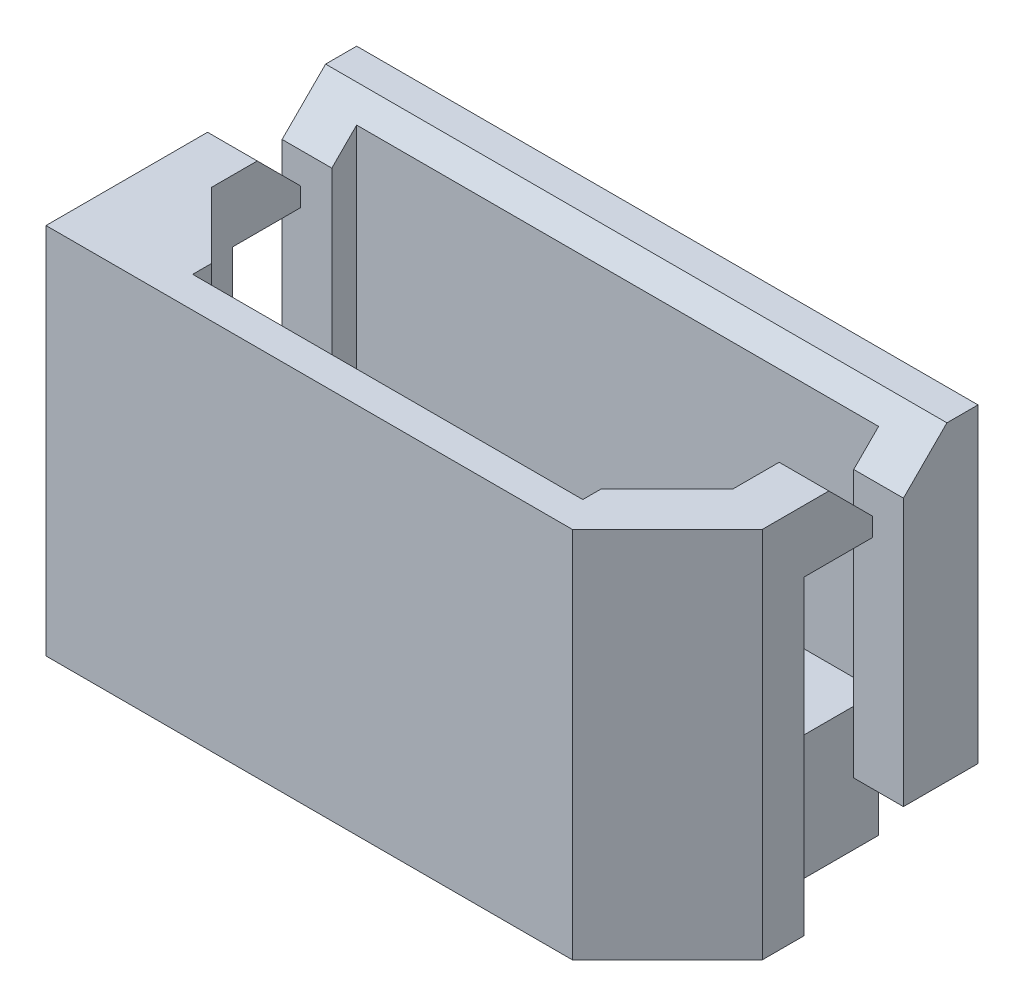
ISO-10303-21;
HEADER;
FILE_DESCRIPTION(('STEP AP214'),'2;1');
FILE_NAME('part.step','',(''),(''),'','','');
FILE_SCHEMA(('AUTOMOTIVE_DESIGN { 1 0 10303 214 1 1 1 1 }'));
ENDSEC;
DATA;
#1=APPLICATION_CONTEXT('core data for automotive mechanical design processes');
#2=APPLICATION_PROTOCOL_DEFINITION('international standard','automotive_design',2000,#1);
#3=PRODUCT_CONTEXT('',#1,'mechanical');
#4=PRODUCT('Part','Part','',(#3));
#5=PRODUCT_RELATED_PRODUCT_CATEGORY('part','',(#4));
#6=PRODUCT_DEFINITION_FORMATION('','',#4);
#7=PRODUCT_DEFINITION_CONTEXT('part definition',#1,'design');
#8=PRODUCT_DEFINITION('design','',#6,#7);
#9=PRODUCT_DEFINITION_SHAPE('','',#8);
#10=(LENGTH_UNIT() NAMED_UNIT(*) SI_UNIT(.MILLI.,.METRE.));
#11=(NAMED_UNIT(*) PLANE_ANGLE_UNIT() SI_UNIT($,.RADIAN.));
#12=(NAMED_UNIT(*) SI_UNIT($,.STERADIAN.) SOLID_ANGLE_UNIT());
#13=UNCERTAINTY_MEASURE_WITH_UNIT(LENGTH_MEASURE(1.E-05),#10,'distance_accuracy_value','');
#14=(GEOMETRIC_REPRESENTATION_CONTEXT(3) GLOBAL_UNCERTAINTY_ASSIGNED_CONTEXT((#13)) GLOBAL_UNIT_ASSIGNED_CONTEXT((#10,
#11,#12)) REPRESENTATION_CONTEXT('',''));
#15=CARTESIAN_POINT('',(0.,0.,0.));
#16=DIRECTION('',(0.,0.,1.));
#17=DIRECTION('',(1.,0.,0.));
#18=AXIS2_PLACEMENT_3D('',#15,#16,#17);
#19=CARTESIAN_POINT('',(2.75,0.,0.7));
#20=DIRECTION('',(0.,1.,0.));
#21=DIRECTION('',(0.,0.,1.));
#22=AXIS2_PLACEMENT_3D('',#19,#20,#21);
#23=CYLINDRICAL_SURFACE('',#22,0.4);
#24=CARTESIAN_POINT('',(2.75,2.,0.7));
#25=DIRECTION('',(0.,1.,0.));
#26=DIRECTION('',(0.,0.,1.));
#27=AXIS2_PLACEMENT_3D('',#24,#25,#26);
#28=CIRCLE('',#27,0.4);
#29=CARTESIAN_POINT('',(2.75,2.,1.1));
#30=VERTEX_POINT('',#29);
#31=EDGE_CURVE('E351',#30,#30,#28,.T.);
#32=ORIENTED_EDGE('',*,*,#31,.T.);
#33=EDGE_LOOP('',(#32));
#34=FACE_BOUND('',#33,.T.);
#35=CARTESIAN_POINT('',(2.75,0.,0.7));
#36=DIRECTION('',(0.,1.,0.));
#37=DIRECTION('',(0.,0.,1.));
#38=AXIS2_PLACEMENT_3D('',#35,#36,#37);
#39=CIRCLE('',#38,0.4);
#40=CARTESIAN_POINT('',(2.75,0.,1.1));
#41=VERTEX_POINT('',#40);
#42=EDGE_CURVE('E319',#41,#41,#39,.T.);
#43=ORIENTED_EDGE('',*,*,#42,.F.);
#44=EDGE_LOOP('',(#43));
#45=FACE_BOUND('',#44,.T.);
#46=ADVANCED_FACE('F17',(#34,#45),#23,.F.);
#47=CARTESIAN_POINT('',(-2.75,0.,0.7));
#48=DIRECTION('',(0.,1.,0.));
#49=DIRECTION('',(0.,0.,1.));
#50=AXIS2_PLACEMENT_3D('',#47,#48,#49);
#51=CYLINDRICAL_SURFACE('',#50,0.4);
#52=CARTESIAN_POINT('',(-2.75,2.,0.7));
#53=DIRECTION('',(0.,1.,0.));
#54=DIRECTION('',(0.,0.,1.));
#55=AXIS2_PLACEMENT_3D('',#52,#53,#54);
#56=CIRCLE('',#55,0.4);
#57=CARTESIAN_POINT('',(-2.75,2.,1.1));
#58=VERTEX_POINT('',#57);
#59=EDGE_CURVE('E348',#58,#58,#56,.T.);
#60=ORIENTED_EDGE('',*,*,#59,.T.);
#61=EDGE_LOOP('',(#60));
#62=FACE_BOUND('',#61,.T.);
#63=CARTESIAN_POINT('',(-2.75,0.,0.7));
#64=DIRECTION('',(0.,1.,0.));
#65=DIRECTION('',(0.,0.,1.));
#66=AXIS2_PLACEMENT_3D('',#63,#64,#65);
#67=CIRCLE('',#66,0.4);
#68=CARTESIAN_POINT('',(-2.75,0.,1.1));
#69=VERTEX_POINT('',#68);
#70=EDGE_CURVE('E27',#69,#69,#67,.T.);
#71=ORIENTED_EDGE('',*,*,#70,.F.);
#72=EDGE_LOOP('',(#71));
#73=FACE_BOUND('',#72,.T.);
#74=ADVANCED_FACE('F716',(#62,#73),#51,.F.);
#75=CARTESIAN_POINT('',(4.2,2.,-1.3));
#76=DIRECTION('',(1.,0.,0.));
#77=DIRECTION('',(0.,0.,-1.));
#78=AXIS2_PLACEMENT_3D('',#75,#76,#77);
#79=PLANE('',#78);
#80=DIRECTION('',(0.,-1.,0.));
#81=VECTOR('',#80,1.);
#82=CARTESIAN_POINT('',(4.2,3.8499999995,-1.7));
#83=LINE('',#82,#81);
#84=CARTESIAN_POINT('',(4.2,5.69999999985,-1.69999999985));
#85=VERTEX_POINT('',#84);
#86=CARTESIAN_POINT('',(4.2,2.,-1.7));
#87=VERTEX_POINT('',#86);
#88=EDGE_CURVE('E377',#85,#87,#83,.T.);
#89=ORIENTED_EDGE('',*,*,#88,.T.);
#90=DIRECTION('',(0.,0.,-1.));
#91=VECTOR('',#90,1.);
#92=CARTESIAN_POINT('',(4.2,2.,-1.5));
#93=LINE('',#92,#91);
#94=CARTESIAN_POINT('',(4.2,2.0000000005,-1.300000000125));
#95=VERTEX_POINT('',#94);
#96=EDGE_CURVE('E941',#95,#87,#93,.T.);
#97=ORIENTED_EDGE('',*,*,#96,.F.);
#98=DIRECTION('',(0.,1.,0.));
#99=VECTOR('',#98,1.);
#100=CARTESIAN_POINT('',(4.2,3.15,-1.3));
#101=LINE('',#100,#99);
#102=CARTESIAN_POINT('',(4.2,5.3,-1.3));
#103=VERTEX_POINT('',#102);
#104=EDGE_CURVE('E371',#95,#103,#101,.T.);
#105=ORIENTED_EDGE('',*,*,#104,.T.);
#106=DIRECTION('',(0.,0.707106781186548,-0.707106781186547));
#107=VECTOR('',#106,1.);
#108=CARTESIAN_POINT('',(4.2,5.3,-1.3));
#109=LINE('',#108,#107);
#110=EDGE_CURVE('E21',#85,#103,#109,.F.);
#111=ORIENTED_EDGE('',*,*,#110,.F.);
#112=EDGE_LOOP('',(#89,#97,#105,#111));
#113=FACE_BOUND('',#112,.T.);
#114=ADVANCED_FACE('F718',(#113),#79,.F.);
#115=CARTESIAN_POINT('',(-4.2,2.,-1.7));
#116=DIRECTION('',(-1.,0.,0.));
#117=DIRECTION('',(0.,0.,1.));
#118=AXIS2_PLACEMENT_3D('',#115,#116,#117);
#119=PLANE('',#118);
#120=DIRECTION('',(0.,-1.,0.));
#121=VECTOR('',#120,1.);
#122=CARTESIAN_POINT('',(-4.2,3.15,-1.3));
#123=LINE('',#122,#121);
#124=CARTESIAN_POINT('',(-4.2,5.29999999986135,-1.3000000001));
#125=VERTEX_POINT('',#124);
#126=CARTESIAN_POINT('',(-4.2,2.0000000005,-1.29999999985));
#127=VERTEX_POINT('',#126);
#128=EDGE_CURVE('E398',#125,#127,#123,.T.);
#129=ORIENTED_EDGE('',*,*,#128,.T.);
#130=DIRECTION('',(0.,0.,1.));
#131=VECTOR('',#130,1.);
#132=CARTESIAN_POINT('',(-4.2,2.,-1.5));
#133=LINE('',#132,#131);
#134=CARTESIAN_POINT('',(-4.2,2.,-1.7));
#135=VERTEX_POINT('',#134);
#136=EDGE_CURVE('E382',#135,#127,#133,.T.);
#137=ORIENTED_EDGE('',*,*,#136,.F.);
#138=DIRECTION('',(0.,1.,0.));
#139=VECTOR('',#138,1.);
#140=CARTESIAN_POINT('',(-4.2,3.8499999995,-1.7));
#141=LINE('',#140,#139);
#142=CARTESIAN_POINT('',(-4.2,5.69999999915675,-1.699999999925));
#143=VERTEX_POINT('',#142);
#144=EDGE_CURVE('E373',#135,#143,#141,.T.);
#145=ORIENTED_EDGE('',*,*,#144,.T.);
#146=DIRECTION('',(0.,-0.707106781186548,0.707106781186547));
#147=VECTOR('',#146,1.);
#148=CARTESIAN_POINT('',(-4.2,5.65,-1.65));
#149=LINE('',#148,#147);
#150=EDGE_CURVE('E395',#143,#125,#149,.T.);
#151=ORIENTED_EDGE('',*,*,#150,.T.);
#152=EDGE_LOOP('',(#129,#137,#145,#151));
#153=FACE_BOUND('',#152,.T.);
#154=ADVANCED_FACE('F701',(#153),#119,.F.);
#155=CARTESIAN_POINT('',(4.2,2.,-1.7));
#156=DIRECTION('',(0.,0.,-1.));
#157=DIRECTION('',(-1.,0.,0.));
#158=AXIS2_PLACEMENT_3D('',#155,#156,#157);
#159=PLANE('',#158);
#160=ORIENTED_EDGE('',*,*,#144,.F.);
#161=DIRECTION('',(1.,0.,0.));
#162=VECTOR('',#161,1.);
#163=CARTESIAN_POINT('',(0.,2.,-1.7));
#164=LINE('',#163,#162);
#165=EDGE_CURVE('E414',#135,#87,#164,.T.);
#166=ORIENTED_EDGE('',*,*,#165,.T.);
#167=ORIENTED_EDGE('',*,*,#88,.F.);
#168=DIRECTION('',(-1.,0.,0.));
#169=VECTOR('',#168,1.);
#170=CARTESIAN_POINT('',(0.,5.6999999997,-1.6999999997));
#171=LINE('',#170,#169);
#172=EDGE_CURVE('E397',#85,#143,#171,.T.);
#173=ORIENTED_EDGE('',*,*,#172,.T.);
#174=EDGE_LOOP('',(#160,#166,#167,#173));
#175=FACE_BOUND('',#174,.T.);
#176=ADVANCED_FACE('F691',(#175),#159,.F.);
#177=CARTESIAN_POINT('',(1.375,2.,1.3));
#178=DIRECTION('',(-0.707106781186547,0.,0.707106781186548));
#179=DIRECTION('',(0.707106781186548,0.,0.707106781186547));
#180=AXIS2_PLACEMENT_3D('',#177,#178,#179);
#181=PLANE('',#180);
#182=DIRECTION('',(0.,-1.,0.));
#183=VECTOR('',#182,1.);
#184=CARTESIAN_POINT('',(1.775,3.85,1.7));
#185=LINE('',#184,#183);
#186=CARTESIAN_POINT('',(1.77500000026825,5.7,1.7));
#187=VERTEX_POINT('',#186);
#188=CARTESIAN_POINT('',(1.775,2.,1.7));
#189=VERTEX_POINT('',#188);
#190=EDGE_CURVE('E401',#187,#189,#185,.T.);
#191=ORIENTED_EDGE('',*,*,#190,.T.);
#192=DIRECTION('',(0.707106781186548,0.,0.707106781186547));
#193=VECTOR('',#192,1.);
#194=CARTESIAN_POINT('',(1.375,2.,1.3));
#195=LINE('',#194,#193);
#196=CARTESIAN_POINT('',(1.375,2.,1.3));
#197=VERTEX_POINT('',#196);
#198=EDGE_CURVE('E357',#189,#197,#195,.F.);
#199=ORIENTED_EDGE('',*,*,#198,.T.);
#200=DIRECTION('',(0.,1.,0.));
#201=VECTOR('',#200,1.);
#202=CARTESIAN_POINT('',(1.375,3.8611,1.3));
#203=LINE('',#202,#201);
#204=CARTESIAN_POINT('',(1.37500000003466,5.29999999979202,1.29999999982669));
#205=VERTEX_POINT('',#204);
#206=EDGE_CURVE('E343',#197,#205,#203,.T.);
#207=ORIENTED_EDGE('',*,*,#206,.T.);
#208=DIRECTION('',(-0.577350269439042,-0.577350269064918,-0.577350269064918));
#209=VECTOR('',#208,1.);
#210=CARTESIAN_POINT('',(1.775,5.6999999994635,1.6999999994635));
#211=LINE('',#210,#209);
#212=EDGE_CURVE('E372',#187,#205,#211,.T.);
#213=ORIENTED_EDGE('',*,*,#212,.F.);
#214=EDGE_LOOP('',(#191,#199,#207,#213));
#215=FACE_BOUND('',#214,.T.);
#216=ADVANCED_FACE('F689',(#215),#181,.F.);
#217=CARTESIAN_POINT('',(-1.775,2.,1.7));
#218=DIRECTION('',(0.707106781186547,0.,0.707106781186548));
#219=DIRECTION('',(0.707106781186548,0.,-0.707106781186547));
#220=AXIS2_PLACEMENT_3D('',#217,#218,#219);
#221=PLANE('',#220);
#222=DIRECTION('',(0.,-1.,0.));
#223=VECTOR('',#222,1.);
#224=CARTESIAN_POINT('',(-1.375,3.8611,1.3));
#225=LINE('',#224,#223);
#226=CARTESIAN_POINT('',(-1.37500000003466,5.29999999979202,1.29999999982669));
#227=VERTEX_POINT('',#226);
#228=CARTESIAN_POINT('',(-1.375,2.,1.3));
#229=VERTEX_POINT('',#228);
#230=EDGE_CURVE('E369',#227,#229,#225,.T.);
#231=ORIENTED_EDGE('',*,*,#230,.T.);
#232=DIRECTION('',(0.707106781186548,0.,-0.707106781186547));
#233=VECTOR('',#232,1.);
#234=CARTESIAN_POINT('',(-1.775,2.,1.7));
#235=LINE('',#234,#233);
#236=CARTESIAN_POINT('',(-1.775,2.,1.7));
#237=VERTEX_POINT('',#236);
#238=EDGE_CURVE('E364',#229,#237,#235,.F.);
#239=ORIENTED_EDGE('',*,*,#238,.T.);
#240=DIRECTION('',(0.,1.,0.));
#241=VECTOR('',#240,1.);
#242=CARTESIAN_POINT('',(-1.775,3.85,1.7));
#243=LINE('',#242,#241);
#244=CARTESIAN_POINT('',(-1.77500000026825,5.7,1.7));
#245=VERTEX_POINT('',#244);
#246=EDGE_CURVE('E562',#237,#245,#243,.T.);
#247=ORIENTED_EDGE('',*,*,#246,.T.);
#248=DIRECTION('',(-0.577350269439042,0.577350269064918,0.577350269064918));
#249=VECTOR('',#248,1.);
#250=CARTESIAN_POINT('',(-1.375,5.2999999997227,1.2999999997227));
#251=LINE('',#250,#249);
#252=EDGE_CURVE('E370',#227,#245,#251,.T.);
#253=ORIENTED_EDGE('',*,*,#252,.F.);
#254=EDGE_LOOP('',(#231,#239,#247,#253));
#255=FACE_BOUND('',#254,.T.);
#256=ADVANCED_FACE('F674',(#255),#221,.F.);
#257=CARTESIAN_POINT('',(4.2,1.,-1.3));
#258=DIRECTION('',(0.,0.,-1.));
#259=DIRECTION('',(0.,1.,0.));
#260=AXIS2_PLACEMENT_3D('',#257,#258,#259);
#261=PLANE('',#260);
#262=DIRECTION('',(-1.,0.,0.));
#263=VECTOR('',#262,1.);
#264=CARTESIAN_POINT('',(4.6,1.,-1.3));
#265=LINE('',#264,#263);
#266=CARTESIAN_POINT('',(5.,1.,-1.3));
#267=VERTEX_POINT('',#266);
#268=CARTESIAN_POINT('',(4.2,1.,-1.3));
#269=VERTEX_POINT('',#268);
#270=EDGE_CURVE('E389',#267,#269,#265,.T.);
#271=ORIENTED_EDGE('',*,*,#270,.F.);
#272=DIRECTION('',(0.,1.,0.));
#273=VECTOR('',#272,1.);
#274=CARTESIAN_POINT('',(5.,3.5,-1.3));
#275=LINE('',#274,#273);
#276=CARTESIAN_POINT('',(5.,5.3,-1.3));
#277=VERTEX_POINT('',#276);
#278=EDGE_CURVE('E339',#267,#277,#275,.T.);
#279=ORIENTED_EDGE('',*,*,#278,.T.);
#280=DIRECTION('',(-1.,0.,0.));
#281=VECTOR('',#280,1.);
#282=CARTESIAN_POINT('',(0.,5.3,-1.3));
#283=LINE('',#282,#281);
#284=EDGE_CURVE('E388',#277,#103,#283,.T.);
#285=ORIENTED_EDGE('',*,*,#284,.T.);
#286=ORIENTED_EDGE('',*,*,#104,.F.);
#287=DIRECTION('',(0.,1.,0.));
#288=VECTOR('',#287,1.);
#289=CARTESIAN_POINT('',(4.2,3.15,-1.3));
#290=LINE('',#289,#288);
#291=EDGE_CURVE('E163',#269,#95,#290,.T.);
#292=ORIENTED_EDGE('',*,*,#291,.F.);
#293=EDGE_LOOP('',(#271,#279,#285,#286,#292));
#294=FACE_BOUND('',#293,.T.);
#295=ADVANCED_FACE('F698',(#294),#261,.F.);
#296=CARTESIAN_POINT('',(-5.,5.3,-1.3));
#297=DIRECTION('',(0.,-0.707106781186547,-0.707106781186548));
#298=DIRECTION('',(0.,0.707106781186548,-0.707106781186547));
#299=AXIS2_PLACEMENT_3D('',#296,#297,#298);
#300=PLANE('',#299);
#301=DIRECTION('',(-1.,0.,0.));
#302=VECTOR('',#301,1.);
#303=CARTESIAN_POINT('',(0.,6.,-2.));
#304=LINE('',#303,#302);
#305=CARTESIAN_POINT('',(5.,6.,-2.));
#306=VERTEX_POINT('',#305);
#307=CARTESIAN_POINT('',(-5.,6.,-1.9999999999));
#308=VERTEX_POINT('',#307);
#309=EDGE_CURVE('E433',#306,#308,#304,.T.);
#310=ORIENTED_EDGE('',*,*,#309,.T.);
#311=DIRECTION('',(0.,0.707106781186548,-0.707106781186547));
#312=VECTOR('',#311,1.);
#313=CARTESIAN_POINT('',(-5.,5.65,-1.65));
#314=LINE('',#313,#312);
#315=CARTESIAN_POINT('',(-5.,5.3,-1.3));
#316=VERTEX_POINT('',#315);
#317=EDGE_CURVE('E392',#316,#308,#314,.T.);
#318=ORIENTED_EDGE('',*,*,#317,.F.);
#319=DIRECTION('',(1.,0.,0.));
#320=VECTOR('',#319,1.);
#321=CARTESIAN_POINT('',(-4.6,5.3,-1.3));
#322=LINE('',#321,#320);
#323=EDGE_CURVE('E402',#316,#125,#322,.T.);
#324=ORIENTED_EDGE('',*,*,#323,.T.);
#325=ORIENTED_EDGE('',*,*,#150,.F.);
#326=ORIENTED_EDGE('',*,*,#172,.F.);
#327=ORIENTED_EDGE('',*,*,#110,.T.);
#328=ORIENTED_EDGE('',*,*,#284,.F.);
#329=DIRECTION('',(0.,0.707106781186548,-0.707106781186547));
#330=VECTOR('',#329,1.);
#331=CARTESIAN_POINT('',(5.,5.3,-1.3));
#332=LINE('',#331,#330);
#333=EDGE_CURVE('E336',#277,#306,#332,.T.);
#334=ORIENTED_EDGE('',*,*,#333,.T.);
#335=EDGE_LOOP('',(#310,#318,#324,#325,#326,#327,#328,#334));
#336=FACE_BOUND('',#335,.T.);
#337=ADVANCED_FACE('F731',(#336),#300,.F.);
#338=CARTESIAN_POINT('',(-5.,1.,-1.3));
#339=DIRECTION('',(0.,0.,-1.));
#340=DIRECTION('',(0.,1.,0.));
#341=AXIS2_PLACEMENT_3D('',#338,#339,#340);
#342=PLANE('',#341);
#343=ORIENTED_EDGE('',*,*,#323,.F.);
#344=DIRECTION('',(0.,-1.,0.));
#345=VECTOR('',#344,1.);
#346=CARTESIAN_POINT('',(-5.,3.5,-1.3));
#347=LINE('',#346,#345);
#348=CARTESIAN_POINT('',(-5.,1.,-1.3));
#349=VERTEX_POINT('',#348);
#350=EDGE_CURVE('E430',#316,#349,#347,.T.);
#351=ORIENTED_EDGE('',*,*,#350,.T.);
#352=DIRECTION('',(-1.,0.,0.));
#353=VECTOR('',#352,1.);
#354=CARTESIAN_POINT('',(-4.6,1.,-1.3));
#355=LINE('',#354,#353);
#356=CARTESIAN_POINT('',(-4.2,1.,-1.3));
#357=VERTEX_POINT('',#356);
#358=EDGE_CURVE('E405',#357,#349,#355,.T.);
#359=ORIENTED_EDGE('',*,*,#358,.F.);
#360=DIRECTION('',(0.,-1.,0.));
#361=VECTOR('',#360,1.);
#362=CARTESIAN_POINT('',(-4.2,3.15,-1.3));
#363=LINE('',#362,#361);
#364=EDGE_CURVE('E394',#127,#357,#363,.T.);
#365=ORIENTED_EDGE('',*,*,#364,.F.);
#366=ORIENTED_EDGE('',*,*,#128,.F.);
#367=EDGE_LOOP('',(#343,#351,#359,#365,#366));
#368=FACE_BOUND('',#367,.T.);
#369=ADVANCED_FACE('F729',(#368),#342,.F.);
#370=CARTESIAN_POINT('',(1.775,2.,1.7));
#371=DIRECTION('',(0.,0.,1.));
#372=DIRECTION('',(1.,0.,0.));
#373=AXIS2_PLACEMENT_3D('',#370,#371,#372);
#374=PLANE('',#373);
#375=DIRECTION('',(0.,-1.,0.));
#376=VECTOR('',#375,1.);
#377=CARTESIAN_POINT('',(3.139339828,4.,1.7));
#378=LINE('',#377,#376);
#379=CARTESIAN_POINT('',(3.13933982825,5.69999999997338,1.7));
#380=VERTEX_POINT('',#379);
#381=CARTESIAN_POINT('',(3.1393398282,2.,1.7));
#382=VERTEX_POINT('',#381);
#383=EDGE_CURVE('E438',#380,#382,#378,.T.);
#384=ORIENTED_EDGE('',*,*,#383,.T.);
#385=DIRECTION('',(-1.,0.,0.));
#386=VECTOR('',#385,1.);
#387=CARTESIAN_POINT('',(0.,2.,1.7));
#388=LINE('',#387,#386);
#389=EDGE_CURVE('E359',#382,#189,#388,.T.);
#390=ORIENTED_EDGE('',*,*,#389,.T.);
#391=ORIENTED_EDGE('',*,*,#190,.F.);
#392=DIRECTION('',(-1.,0.,0.));
#393=VECTOR('',#392,1.);
#394=CARTESIAN_POINT('',(2.457169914,5.7,1.7));
#395=LINE('',#394,#393);
#396=EDGE_CURVE('E555',#380,#187,#395,.T.);
#397=ORIENTED_EDGE('',*,*,#396,.F.);
#398=EDGE_LOOP('',(#384,#390,#391,#397));
#399=FACE_BOUND('',#398,.T.);
#400=ADVANCED_FACE('F688',(#399),#374,.F.);
#401=CARTESIAN_POINT('',(-1.375,2.,1.3));
#402=DIRECTION('',(-0.707106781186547,0.,0.707106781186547));
#403=DIRECTION('',(0.707106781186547,0.,0.707106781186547));
#404=AXIS2_PLACEMENT_3D('',#401,#402,#403);
#405=PLANE('',#404);
#406=DIRECTION('',(0.,-1.,0.));
#407=VECTOR('',#406,1.);
#408=CARTESIAN_POINT('',(-0.975,3.85,1.7));
#409=LINE('',#408,#407);
#410=CARTESIAN_POINT('',(-0.974999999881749,5.6999999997,1.699999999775));
#411=VERTEX_POINT('',#410);
#412=CARTESIAN_POINT('',(-0.975,2.,1.7));
#413=VERTEX_POINT('',#412);
#414=EDGE_CURVE('E437',#411,#413,#409,.T.);
#415=ORIENTED_EDGE('',*,*,#414,.T.);
#416=DIRECTION('',(0.707106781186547,0.,0.707106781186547));
#417=VECTOR('',#416,1.);
#418=CARTESIAN_POINT('',(-1.375,2.,1.3));
#419=LINE('',#418,#417);
#420=EDGE_CURVE('E354',#413,#229,#419,.F.);
#421=ORIENTED_EDGE('',*,*,#420,.T.);
#422=ORIENTED_EDGE('',*,*,#230,.F.);
#423=DIRECTION('',(-0.577350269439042,-0.577350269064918,-0.577350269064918));
#424=VECTOR('',#423,1.);
#425=CARTESIAN_POINT('',(-0.975,5.6999999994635,1.6999999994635));
#426=LINE('',#425,#424);
#427=EDGE_CURVE('E366',#411,#227,#426,.T.);
#428=ORIENTED_EDGE('',*,*,#427,.F.);
#429=EDGE_LOOP('',(#415,#421,#422,#428));
#430=FACE_BOUND('',#429,.T.);
#431=ADVANCED_FACE('F676',(#430),#405,.F.);
#432=CARTESIAN_POINT('',(-4.2,2.,1.7));
#433=DIRECTION('',(0.,-1.,0.));
#434=DIRECTION('',(0.,0.,-1.));
#435=AXIS2_PLACEMENT_3D('',#432,#433,#434);
#436=PLANE('',#435);
#437=CARTESIAN_POINT('',(0.,2.,0.7));
#438=DIRECTION('',(0.,1.,0.));
#439=DIRECTION('',(0.,0.,1.));
#440=AXIS2_PLACEMENT_3D('',#437,#438,#439);
#441=CIRCLE('',#440,0.4);
#442=CARTESIAN_POINT('',(0.,2.,1.1));
#443=VERTEX_POINT('',#442);
#444=EDGE_CURVE('E344',#443,#443,#441,.T.);
#445=ORIENTED_EDGE('',*,*,#444,.F.);
#446=EDGE_LOOP('',(#445));
#447=FACE_BOUND('',#446,.T.);
#448=ORIENTED_EDGE('',*,*,#59,.F.);
#449=EDGE_LOOP('',(#448));
#450=FACE_BOUND('',#449,.T.);
#451=ORIENTED_EDGE('',*,*,#31,.F.);
#452=EDGE_LOOP('',(#451));
#453=FACE_BOUND('',#452,.T.);
#454=DIRECTION('',(1.,0.,0.));
#455=VECTOR('',#454,1.);
#456=CARTESIAN_POINT('',(1.00000005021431E-09,2.,1.7));
#457=LINE('',#456,#455);
#458=CARTESIAN_POINT('',(0.9750000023,2.,1.7));
#459=VERTEX_POINT('',#458);
#460=EDGE_CURVE('E567',#413,#459,#457,.T.);
#461=ORIENTED_EDGE('',*,*,#460,.T.);
#462=DIRECTION('',(0.707106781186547,0.,-0.707106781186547));
#463=VECTOR('',#462,1.);
#464=CARTESIAN_POINT('',(1.175,2.,1.5));
#465=LINE('',#464,#463);
#466=EDGE_CURVE('E347',#459,#197,#465,.T.);
#467=ORIENTED_EDGE('',*,*,#466,.T.);
#468=ORIENTED_EDGE('',*,*,#198,.F.);
#469=ORIENTED_EDGE('',*,*,#389,.F.);
#470=DIRECTION('',(0.707106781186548,0.,-0.707106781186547));
#471=VECTOR('',#470,1.);
#472=CARTESIAN_POINT('',(3.669669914,2.,1.169669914));
#473=LINE('',#472,#471);
#474=CARTESIAN_POINT('',(4.2,2.,0.6393398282));
#475=VERTEX_POINT('',#474);
#476=EDGE_CURVE('E434',#382,#475,#473,.T.);
#477=ORIENTED_EDGE('',*,*,#476,.T.);
#478=DIRECTION('',(0.,0.,1.));
#479=VECTOR('',#478,1.);
#480=CARTESIAN_POINT('',(4.2,2.,0.));
#481=LINE('',#480,#479);
#482=CARTESIAN_POINT('',(4.2,1.99999999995,0.299999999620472));
#483=VERTEX_POINT('',#482);
#484=EDGE_CURVE('E409',#483,#475,#481,.T.);
#485=ORIENTED_EDGE('',*,*,#484,.F.);
#486=DIRECTION('',(0.,0.,1.));
#487=VECTOR('',#486,1.);
#488=CARTESIAN_POINT('',(4.2,2.,0.));
#489=LINE('',#488,#487);
#490=EDGE_CURVE('E411',#95,#483,#489,.T.);
#491=ORIENTED_EDGE('',*,*,#490,.F.);
#492=ORIENTED_EDGE('',*,*,#96,.T.);
#493=ORIENTED_EDGE('',*,*,#165,.F.);
#494=ORIENTED_EDGE('',*,*,#136,.T.);
#495=DIRECTION('',(0.,0.,-1.));
#496=VECTOR('',#495,1.);
#497=CARTESIAN_POINT('',(-4.2,2.,0.));
#498=LINE('',#497,#496);
#499=CARTESIAN_POINT('',(-4.2,2.,0.299999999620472));
#500=VERTEX_POINT('',#499);
#501=EDGE_CURVE('E417',#500,#127,#498,.T.);
#502=ORIENTED_EDGE('',*,*,#501,.F.);
#503=DIRECTION('',(0.,0.,-1.));
#504=VECTOR('',#503,1.);
#505=CARTESIAN_POINT('',(-4.2,2.,0.));
#506=LINE('',#505,#504);
#507=CARTESIAN_POINT('',(-4.2,2.,0.639339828));
#508=VERTEX_POINT('',#507);
#509=EDGE_CURVE('E363',#508,#500,#506,.T.);
#510=ORIENTED_EDGE('',*,*,#509,.F.);
#511=DIRECTION('',(0.707106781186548,0.,0.707106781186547));
#512=VECTOR('',#511,1.);
#513=CARTESIAN_POINT('',(-4.2,2.,0.639339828));
#514=LINE('',#513,#512);
#515=CARTESIAN_POINT('',(-3.139339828,2.,1.7));
#516=VERTEX_POINT('',#515);
#517=EDGE_CURVE('E360',#516,#508,#514,.F.);
#518=ORIENTED_EDGE('',*,*,#517,.F.);
#519=DIRECTION('',(1.,0.,0.));
#520=VECTOR('',#519,1.);
#521=CARTESIAN_POINT('',(-2.457169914,2.,1.7));
#522=LINE('',#521,#520);
#523=EDGE_CURVE('E342',#516,#237,#522,.T.);
#524=ORIENTED_EDGE('',*,*,#523,.T.);
#525=ORIENTED_EDGE('',*,*,#238,.F.);
#526=ORIENTED_EDGE('',*,*,#420,.F.);
#527=EDGE_LOOP('',(#461,#467,#468,#469,#477,#485,#491,#492,#493,#494,#502,#510,#518,#524,#525,#526));
#528=FACE_BOUND('',#527,.T.);
#529=ADVANCED_FACE('F627',(#447,#450,#453,#528),#436,.F.);
#530=CARTESIAN_POINT('',(0.975,2.,1.7));
#531=DIRECTION('',(0.707106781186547,0.,0.707106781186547));
#532=DIRECTION('',(0.707106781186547,0.,-0.707106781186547));
#533=AXIS2_PLACEMENT_3D('',#530,#531,#532);
#534=PLANE('',#533);
#535=ORIENTED_EDGE('',*,*,#206,.F.);
#536=ORIENTED_EDGE('',*,*,#466,.F.);
#537=DIRECTION('',(0.,1.,0.));
#538=VECTOR('',#537,1.);
#539=CARTESIAN_POINT('',(0.975000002,3.85,1.7));
#540=LINE('',#539,#538);
#541=CARTESIAN_POINT('',(0.975000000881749,5.6999999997,1.699999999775));
#542=VERTEX_POINT('',#541);
#543=EDGE_CURVE('E445',#459,#542,#540,.T.);
#544=ORIENTED_EDGE('',*,*,#543,.T.);
#545=DIRECTION('',(-0.577350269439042,0.577350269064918,0.577350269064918));
#546=VECTOR('',#545,1.);
#547=CARTESIAN_POINT('',(1.375,5.2999999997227,1.2999999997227));
#548=LINE('',#547,#546);
#549=EDGE_CURVE('E340',#205,#542,#548,.T.);
#550=ORIENTED_EDGE('',*,*,#549,.F.);
#551=EDGE_LOOP('',(#535,#536,#544,#550));
#552=FACE_BOUND('',#551,.T.);
#553=ADVANCED_FACE('F683',(#552),#534,.F.);
#554=CARTESIAN_POINT('',(-3.139339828,2.,1.7));
#555=DIRECTION('',(0.,0.,1.));
#556=DIRECTION('',(1.,0.,0.));
#557=AXIS2_PLACEMENT_3D('',#554,#555,#556);
#558=PLANE('',#557);
#559=ORIENTED_EDGE('',*,*,#246,.F.);
#560=ORIENTED_EDGE('',*,*,#523,.F.);
#561=DIRECTION('',(0.,1.,0.));
#562=VECTOR('',#561,1.);
#563=CARTESIAN_POINT('',(-3.139339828,4.,1.7));
#564=LINE('',#563,#562);
#565=CARTESIAN_POINT('',(-3.139339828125,5.69999999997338,1.70000000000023));
#566=VERTEX_POINT('',#565);
#567=EDGE_CURVE('E444',#516,#566,#564,.T.);
#568=ORIENTED_EDGE('',*,*,#567,.T.);
#569=DIRECTION('',(-1.,0.,0.));
#570=VECTOR('',#569,1.);
#571=CARTESIAN_POINT('',(-2.457169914,5.7,1.7));
#572=LINE('',#571,#570);
#573=EDGE_CURVE('E423',#245,#566,#572,.T.);
#574=ORIENTED_EDGE('',*,*,#573,.F.);
#575=EDGE_LOOP('',(#559,#560,#568,#574));
#576=FACE_BOUND('',#575,.T.);
#577=ADVANCED_FACE('F670',(#576),#558,.F.);
#578=CARTESIAN_POINT('',(5.,1.,-2.5));
#579=DIRECTION('',(-1.,0.,0.));
#580=DIRECTION('',(0.,0.,1.));
#581=AXIS2_PLACEMENT_3D('',#578,#579,#580);
#582=PLANE('',#581);
#583=ORIENTED_EDGE('',*,*,#278,.F.);
#584=DIRECTION('',(0.,0.,1.));
#585=VECTOR('',#584,1.);
#586=CARTESIAN_POINT('',(5.,1.,-1.9));
#587=LINE('',#586,#585);
#588=CARTESIAN_POINT('',(5.,1.,-2.5));
#589=VERTEX_POINT('',#588);
#590=EDGE_CURVE('E420',#589,#267,#587,.T.);
#591=ORIENTED_EDGE('',*,*,#590,.F.);
#592=DIRECTION('',(0.,1.,0.));
#593=VECTOR('',#592,1.);
#594=CARTESIAN_POINT('',(5.,3.5,-2.5));
#595=LINE('',#594,#593);
#596=CARTESIAN_POINT('',(5.,6.,-2.5));
#597=VERTEX_POINT('',#596);
#598=EDGE_CURVE('E453',#589,#597,#595,.T.);
#599=ORIENTED_EDGE('',*,*,#598,.T.);
#600=DIRECTION('',(0.,0.,1.));
#601=VECTOR('',#600,1.);
#602=CARTESIAN_POINT('',(5.,6.,-2.25));
#603=LINE('',#602,#601);
#604=EDGE_CURVE('E338',#597,#306,#603,.T.);
#605=ORIENTED_EDGE('',*,*,#604,.T.);
#606=ORIENTED_EDGE('',*,*,#333,.F.);
#607=EDGE_LOOP('',(#583,#591,#599,#605,#606));
#608=FACE_BOUND('',#607,.T.);
#609=ADVANCED_FACE('F852',(#608),#582,.F.);
#610=CARTESIAN_POINT('',(-5.,6.,-2.));
#611=DIRECTION('',(0.,-1.,0.));
#612=DIRECTION('',(0.,0.,-1.));
#613=AXIS2_PLACEMENT_3D('',#610,#611,#612);
#614=PLANE('',#613);
#615=ORIENTED_EDGE('',*,*,#604,.F.);
#616=DIRECTION('',(-1.,0.,0.));
#617=VECTOR('',#616,1.);
#618=CARTESIAN_POINT('',(0.,6.,-2.5));
#619=LINE('',#618,#617);
#620=CARTESIAN_POINT('',(-5.,6.,-2.5));
#621=VERTEX_POINT('',#620);
#622=EDGE_CURVE('E450',#597,#621,#619,.T.);
#623=ORIENTED_EDGE('',*,*,#622,.T.);
#624=DIRECTION('',(0.,0.,1.));
#625=VECTOR('',#624,1.);
#626=CARTESIAN_POINT('',(-5.,6.,-1.9));
#627=LINE('',#626,#625);
#628=EDGE_CURVE('E424',#621,#308,#627,.T.);
#629=ORIENTED_EDGE('',*,*,#628,.T.);
#630=ORIENTED_EDGE('',*,*,#309,.F.);
#631=EDGE_LOOP('',(#615,#623,#629,#630));
#632=FACE_BOUND('',#631,.T.);
#633=ADVANCED_FACE('F845',(#632),#614,.F.);
#634=CARTESIAN_POINT('',(-5.,1.,-1.3));
#635=DIRECTION('',(1.,0.,0.));
#636=DIRECTION('',(0.,0.,-1.));
#637=AXIS2_PLACEMENT_3D('',#634,#635,#636);
#638=PLANE('',#637);
#639=ORIENTED_EDGE('',*,*,#628,.F.);
#640=DIRECTION('',(0.,-1.,0.));
#641=VECTOR('',#640,1.);
#642=CARTESIAN_POINT('',(-5.,3.5,-2.5));
#643=LINE('',#642,#641);
#644=CARTESIAN_POINT('',(-5.,1.,-2.5));
#645=VERTEX_POINT('',#644);
#646=EDGE_CURVE('E446',#621,#645,#643,.T.);
#647=ORIENTED_EDGE('',*,*,#646,.T.);
#648=DIRECTION('',(0.,0.,-1.));
#649=VECTOR('',#648,1.);
#650=CARTESIAN_POINT('',(-5.,1.,-1.9));
#651=LINE('',#650,#649);
#652=EDGE_CURVE('E428',#349,#645,#651,.T.);
#653=ORIENTED_EDGE('',*,*,#652,.F.);
#654=ORIENTED_EDGE('',*,*,#350,.F.);
#655=ORIENTED_EDGE('',*,*,#317,.T.);
#656=EDGE_LOOP('',(#639,#647,#653,#654,#655));
#657=FACE_BOUND('',#656,.T.);
#658=ADVANCED_FACE('F734',(#657),#638,.F.);
#659=CARTESIAN_POINT('',(3.139339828,2.,1.7));
#660=DIRECTION('',(0.707106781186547,0.,0.707106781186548));
#661=DIRECTION('',(0.707106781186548,0.,-0.707106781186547));
#662=AXIS2_PLACEMENT_3D('',#659,#660,#661);
#663=PLANE('',#662);
#664=ORIENTED_EDGE('',*,*,#476,.F.);
#665=ORIENTED_EDGE('',*,*,#383,.F.);
#666=DIRECTION('',(0.,-1.,0.));
#667=VECTOR('',#666,1.);
#668=CARTESIAN_POINT('',(3.139339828,4.,1.7));
#669=LINE('',#668,#667);
#670=CARTESIAN_POINT('',(3.1393398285,6.,1.69999999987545));
#671=VERTEX_POINT('',#670);
#672=EDGE_CURVE('E441',#671,#380,#669,.T.);
#673=ORIENTED_EDGE('',*,*,#672,.F.);
#674=DIRECTION('',(-0.707106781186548,0.,0.707106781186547));
#675=VECTOR('',#674,1.);
#676=CARTESIAN_POINT('',(3.669669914,6.,1.169669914));
#677=LINE('',#676,#675);
#678=CARTESIAN_POINT('',(4.2,6.,0.6393398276));
#679=VERTEX_POINT('',#678);
#680=EDGE_CURVE('E427',#679,#671,#677,.T.);
#681=ORIENTED_EDGE('',*,*,#680,.F.);
#682=DIRECTION('',(0.,-1.,0.));
#683=VECTOR('',#682,1.);
#684=CARTESIAN_POINT('',(4.2,4.,0.639339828));
#685=LINE('',#684,#683);
#686=EDGE_CURVE('E456',#679,#475,#685,.T.);
#687=ORIENTED_EDGE('',*,*,#686,.T.);
#688=EDGE_LOOP('',(#664,#665,#673,#681,#687));
#689=FACE_BOUND('',#688,.T.);
#690=ADVANCED_FACE('F654',(#689),#663,.F.);
#691=CARTESIAN_POINT('',(-0.975,2.,1.7));
#692=DIRECTION('',(0.,0.,1.));
#693=DIRECTION('',(1.,0.,0.));
#694=AXIS2_PLACEMENT_3D('',#691,#692,#693);
#695=PLANE('',#694);
#696=ORIENTED_EDGE('',*,*,#543,.F.);
#697=ORIENTED_EDGE('',*,*,#460,.F.);
#698=ORIENTED_EDGE('',*,*,#414,.F.);
#699=DIRECTION('',(1.,0.,0.));
#700=VECTOR('',#699,1.);
#701=CARTESIAN_POINT('',(0.,5.6999999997,1.6999999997));
#702=LINE('',#701,#700);
#703=EDGE_CURVE('E335',#411,#542,#702,.T.);
#704=ORIENTED_EDGE('',*,*,#703,.T.);
#705=EDGE_LOOP('',(#696,#697,#698,#704));
#706=FACE_BOUND('',#705,.T.);
#707=ADVANCED_FACE('F680',(#706),#695,.F.);
#708=CARTESIAN_POINT('',(-4.2,2.,0.639339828));
#709=DIRECTION('',(-0.707106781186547,0.,0.707106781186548));
#710=DIRECTION('',(0.707106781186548,0.,0.707106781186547));
#711=AXIS2_PLACEMENT_3D('',#708,#709,#710);
#712=PLANE('',#711);
#713=ORIENTED_EDGE('',*,*,#567,.F.);
#714=ORIENTED_EDGE('',*,*,#517,.T.);
#715=DIRECTION('',(0.,1.,0.));
#716=VECTOR('',#715,1.);
#717=CARTESIAN_POINT('',(-4.2,4.,0.639339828));
#718=LINE('',#717,#716);
#719=CARTESIAN_POINT('',(-4.2,6.,0.6393398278));
#720=VERTEX_POINT('',#719);
#721=EDGE_CURVE('E487',#508,#720,#718,.T.);
#722=ORIENTED_EDGE('',*,*,#721,.T.);
#723=DIRECTION('',(-0.707106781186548,0.,-0.707106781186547));
#724=VECTOR('',#723,1.);
#725=CARTESIAN_POINT('',(-3.669669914,6.,1.169669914));
#726=LINE('',#725,#724);
#727=CARTESIAN_POINT('',(-3.1393398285,6.,1.69999999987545));
#728=VERTEX_POINT('',#727);
#729=EDGE_CURVE('E442',#728,#720,#726,.T.);
#730=ORIENTED_EDGE('',*,*,#729,.F.);
#731=DIRECTION('',(0.,1.,0.));
#732=VECTOR('',#731,1.);
#733=CARTESIAN_POINT('',(-3.139339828,5.8491,1.7000000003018));
#734=LINE('',#733,#732);
#735=EDGE_CURVE('E468',#566,#728,#734,.T.);
#736=ORIENTED_EDGE('',*,*,#735,.F.);
#737=EDGE_LOOP('',(#713,#714,#722,#730,#736));
#738=FACE_BOUND('',#737,.T.);
#739=ADVANCED_FACE('F666',(#738),#712,.F.);
#740=CARTESIAN_POINT('',(-5.,1.,-2.5));
#741=DIRECTION('',(0.,0.,1.));
#742=DIRECTION('',(1.,0.,0.));
#743=AXIS2_PLACEMENT_3D('',#740,#741,#742);
#744=PLANE('',#743);
#745=ORIENTED_EDGE('',*,*,#646,.F.);
#746=ORIENTED_EDGE('',*,*,#622,.F.);
#747=ORIENTED_EDGE('',*,*,#598,.F.);
#748=DIRECTION('',(-1.,0.,0.));
#749=VECTOR('',#748,1.);
#750=CARTESIAN_POINT('',(0.,1.,-2.5));
#751=LINE('',#750,#749);
#752=EDGE_CURVE('E478',#589,#645,#751,.T.);
#753=ORIENTED_EDGE('',*,*,#752,.T.);
#754=EDGE_LOOP('',(#745,#746,#747,#753));
#755=FACE_BOUND('',#754,.T.);
#756=ADVANCED_FACE('F766',(#755),#744,.F.);
#757=CARTESIAN_POINT('',(4.2,2.,0.639339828));
#758=DIRECTION('',(1.,0.,0.));
#759=DIRECTION('',(0.,0.,-1.));
#760=AXIS2_PLACEMENT_3D('',#757,#758,#759);
#761=PLANE('',#760);
#762=DIRECTION('',(0.,-1.,0.));
#763=VECTOR('',#762,1.);
#764=CARTESIAN_POINT('',(4.2,5.15,-0.8));
#765=LINE('',#764,#763);
#766=CARTESIAN_POINT('',(4.2,5.3,-0.8));
#767=VERTEX_POINT('',#766);
#768=CARTESIAN_POINT('',(4.2,5.,-0.8));
#769=VERTEX_POINT('',#768);
#770=EDGE_CURVE('E459',#767,#769,#765,.T.);
#771=ORIENTED_EDGE('',*,*,#770,.T.);
#772=DIRECTION('',(0.,0.,1.));
#773=VECTOR('',#772,1.);
#774=CARTESIAN_POINT('',(4.2,5.,-0.25));
#775=LINE('',#774,#773);
#776=CARTESIAN_POINT('',(4.2,4.99999999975,0.299999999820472));
#777=VERTEX_POINT('',#776);
#778=EDGE_CURVE('E464',#769,#777,#775,.T.);
#779=ORIENTED_EDGE('',*,*,#778,.T.);
#780=DIRECTION('',(0.,-1.,0.));
#781=VECTOR('',#780,1.);
#782=CARTESIAN_POINT('',(4.2,2.4999999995,0.3));
#783=LINE('',#782,#781);
#784=EDGE_CURVE('E488',#777,#483,#783,.T.);
#785=ORIENTED_EDGE('',*,*,#784,.T.);
#786=ORIENTED_EDGE('',*,*,#484,.T.);
#787=ORIENTED_EDGE('',*,*,#686,.F.);
#788=DIRECTION('',(0.,0.,1.));
#789=VECTOR('',#788,1.);
#790=CARTESIAN_POINT('',(4.2,6.,-0.080330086));
#791=LINE('',#790,#789);
#792=CARTESIAN_POINT('',(4.2,6.,-0.10000000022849));
#793=VERTEX_POINT('',#792);
#794=EDGE_CURVE('E449',#793,#679,#791,.T.);
#795=ORIENTED_EDGE('',*,*,#794,.F.);
#796=DIRECTION('',(0.,-0.707106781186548,-0.707106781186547));
#797=VECTOR('',#796,1.);
#798=CARTESIAN_POINT('',(4.2,5.65,-0.45));
#799=LINE('',#798,#797);
#800=EDGE_CURVE('E334',#793,#767,#799,.T.);
#801=ORIENTED_EDGE('',*,*,#800,.T.);
#802=EDGE_LOOP('',(#771,#779,#785,#786,#787,#795,#801));
#803=FACE_BOUND('',#802,.T.);
#804=ADVANCED_FACE('F648',(#803),#761,.F.);
#805=CARTESIAN_POINT('',(4.2,5.,-0.8));
#806=DIRECTION('',(0.,0.,1.));
#807=DIRECTION('',(1.,0.,0.));
#808=AXIS2_PLACEMENT_3D('',#805,#806,#807);
#809=PLANE('',#808);
#810=DIRECTION('',(-1.,0.,0.));
#811=VECTOR('',#810,1.);
#812=CARTESIAN_POINT('',(4.6,5.,-0.8));
#813=LINE('',#812,#811);
#814=CARTESIAN_POINT('',(5.,4.9999999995,-0.8));
#815=VERTEX_POINT('',#814);
#816=EDGE_CURVE('E465',#815,#769,#813,.T.);
#817=ORIENTED_EDGE('',*,*,#816,.T.);
#818=ORIENTED_EDGE('',*,*,#770,.F.);
#819=DIRECTION('',(1.,0.,0.));
#820=VECTOR('',#819,1.);
#821=CARTESIAN_POINT('',(4.6,5.3,-0.8));
#822=LINE('',#821,#820);
#823=CARTESIAN_POINT('',(5.,5.3,-0.8));
#824=VERTEX_POINT('',#823);
#825=EDGE_CURVE('E477',#767,#824,#822,.T.);
#826=ORIENTED_EDGE('',*,*,#825,.T.);
#827=DIRECTION('',(0.,-1.,0.));
#828=VECTOR('',#827,1.);
#829=CARTESIAN_POINT('',(5.,3.,-0.8));
#830=LINE('',#829,#828);
#831=EDGE_CURVE('E491',#824,#815,#830,.T.);
#832=ORIENTED_EDGE('',*,*,#831,.T.);
#833=EDGE_LOOP('',(#817,#818,#826,#832));
#834=FACE_BOUND('',#833,.T.);
#835=ADVANCED_FACE('F758',(#834),#809,.F.);
#836=CARTESIAN_POINT('',(4.2,5.,-0.8));
#837=DIRECTION('',(0.,1.,0.));
#838=DIRECTION('',(0.,0.,1.));
#839=AXIS2_PLACEMENT_3D('',#836,#837,#838);
#840=PLANE('',#839);
#841=DIRECTION('',(0.,0.,1.));
#842=VECTOR('',#841,1.);
#843=CARTESIAN_POINT('',(5.,4.999999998,0.085355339));
#844=LINE('',#843,#842);
#845=CARTESIAN_POINT('',(5.,4.99999999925,0.300000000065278));
#846=VERTEX_POINT('',#845);
#847=EDGE_CURVE('E498',#815,#846,#844,.T.);
#848=ORIENTED_EDGE('',*,*,#847,.T.);
#849=DIRECTION('',(-1.,0.,0.));
#850=VECTOR('',#849,1.);
#851=CARTESIAN_POINT('',(4.6,4.999999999,0.3));
#852=LINE('',#851,#850);
#853=EDGE_CURVE('E492',#846,#777,#852,.T.);
#854=ORIENTED_EDGE('',*,*,#853,.T.);
#855=ORIENTED_EDGE('',*,*,#778,.F.);
#856=ORIENTED_EDGE('',*,*,#816,.F.);
#857=EDGE_LOOP('',(#848,#854,#855,#856));
#858=FACE_BOUND('',#857,.T.);
#859=ADVANCED_FACE('F756',(#858),#840,.F.);
#860=CARTESIAN_POINT('',(-3.139339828,5.6982,2.001800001));
#861=DIRECTION('',(1.,0.,0.));
#862=DIRECTION('',(0.,0.,-1.));
#863=AXIS2_PLACEMENT_3D('',#860,#861,#862);
#864=PLANE('',#863);
#865=DIRECTION('',(0.,-0.707106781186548,-0.707106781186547));
#866=VECTOR('',#865,1.);
#867=CARTESIAN_POINT('',(-3.139339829,5.65,1.65));
#868=LINE('',#867,#866);
#869=CARTESIAN_POINT('',(-3.13933982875,6.,2.00000000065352));
#870=VERTEX_POINT('',#869);
#871=EDGE_CURVE('E472',#870,#566,#868,.T.);
#872=ORIENTED_EDGE('',*,*,#871,.T.);
#873=ORIENTED_EDGE('',*,*,#735,.T.);
#874=DIRECTION('',(0.,0.,1.));
#875=VECTOR('',#874,1.);
#876=CARTESIAN_POINT('',(-3.13933983,6.,1.2));
#877=LINE('',#876,#875);
#878=EDGE_CURVE('E330',#728,#870,#877,.T.);
#879=ORIENTED_EDGE('',*,*,#878,.T.);
#880=EDGE_LOOP('',(#872,#873,#879));
#881=FACE_BOUND('',#880,.T.);
#882=ADVANCED_FACE('F662',(#881),#864,.T.);
#883=CARTESIAN_POINT('',(-3.139339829,6.,2.));
#884=DIRECTION('',(0.,-0.707106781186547,0.707106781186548));
#885=DIRECTION('',(0.,-0.707106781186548,-0.707106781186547));
#886=AXIS2_PLACEMENT_3D('',#883,#884,#885);
#887=PLANE('',#886);
#888=ORIENTED_EDGE('',*,*,#703,.F.);
#889=ORIENTED_EDGE('',*,*,#427,.T.);
#890=ORIENTED_EDGE('',*,*,#252,.T.);
#891=ORIENTED_EDGE('',*,*,#573,.T.);
#892=ORIENTED_EDGE('',*,*,#871,.F.);
#893=DIRECTION('',(1.,0.,0.));
#894=VECTOR('',#893,1.);
#895=CARTESIAN_POINT('',(0.,6.,2.0000000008));
#896=LINE('',#895,#894);
#897=CARTESIAN_POINT('',(3.13933982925,6.0000000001,2.0000000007));
#898=VERTEX_POINT('',#897);
#899=EDGE_CURVE('E508',#870,#898,#896,.T.);
#900=ORIENTED_EDGE('',*,*,#899,.T.);
#901=DIRECTION('',(0.,-0.707106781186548,-0.707106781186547));
#902=VECTOR('',#901,1.);
#903=CARTESIAN_POINT('',(3.1393398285,6.,2.));
#904=LINE('',#903,#902);
#905=EDGE_CURVE('E331',#898,#380,#904,.T.);
#906=ORIENTED_EDGE('',*,*,#905,.T.);
#907=ORIENTED_EDGE('',*,*,#396,.T.);
#908=ORIENTED_EDGE('',*,*,#212,.T.);
#909=ORIENTED_EDGE('',*,*,#549,.T.);
#910=EDGE_LOOP('',(#888,#889,#890,#891,#892,#900,#906,#907,#908,#909));
#911=FACE_BOUND('',#910,.T.);
#912=ADVANCED_FACE('F659',(#911),#887,.F.);
#913=CARTESIAN_POINT('',(3.139339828,5.6982,2.001800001));
#914=DIRECTION('',(1.,0.,0.));
#915=DIRECTION('',(0.,0.,-1.));
#916=AXIS2_PLACEMENT_3D('',#913,#914,#915);
#917=PLANE('',#916);
#918=ORIENTED_EDGE('',*,*,#672,.T.);
#919=ORIENTED_EDGE('',*,*,#905,.F.);
#920=DIRECTION('',(0.,0.,-1.));
#921=VECTOR('',#920,1.);
#922=CARTESIAN_POINT('',(3.13933983,6.,1.2));
#923=LINE('',#922,#921);
#924=EDGE_CURVE('E592',#898,#671,#923,.T.);
#925=ORIENTED_EDGE('',*,*,#924,.T.);
#926=EDGE_LOOP('',(#918,#919,#925));
#927=FACE_BOUND('',#926,.T.);
#928=ADVANCED_FACE('F657',(#927),#917,.F.);
#929=CARTESIAN_POINT('',(4.2,6.,-0.1));
#930=DIRECTION('',(0.,-0.707106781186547,0.707106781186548));
#931=DIRECTION('',(0.,-0.707106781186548,-0.707106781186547));
#932=AXIS2_PLACEMENT_3D('',#929,#930,#931);
#933=PLANE('',#932);
#934=ORIENTED_EDGE('',*,*,#825,.F.);
#935=ORIENTED_EDGE('',*,*,#800,.F.);
#936=DIRECTION('',(1.,0.,0.));
#937=VECTOR('',#936,1.);
#938=CARTESIAN_POINT('',(0.,6.,-0.1));
#939=LINE('',#938,#937);
#940=CARTESIAN_POINT('',(5.,6.,-0.1));
#941=VERTEX_POINT('',#940);
#942=EDGE_CURVE('E595',#793,#941,#939,.T.);
#943=ORIENTED_EDGE('',*,*,#942,.T.);
#944=DIRECTION('',(0.,-0.707106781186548,-0.707106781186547));
#945=VECTOR('',#944,1.);
#946=CARTESIAN_POINT('',(5.,6.,-0.1));
#947=LINE('',#946,#945);
#948=EDGE_CURVE('E309',#941,#824,#947,.T.);
#949=ORIENTED_EDGE('',*,*,#948,.T.);
#950=EDGE_LOOP('',(#934,#935,#943,#949));
#951=FACE_BOUND('',#950,.T.);
#952=ADVANCED_FACE('F646',(#951),#933,.F.);
#953=CARTESIAN_POINT('',(-4.2,2.,-0.8));
#954=DIRECTION('',(-1.,0.,0.));
#955=DIRECTION('',(0.,0.,1.));
#956=AXIS2_PLACEMENT_3D('',#953,#954,#955);
#957=PLANE('',#956);
#958=DIRECTION('',(0.,0.,1.));
#959=VECTOR('',#958,1.);
#960=CARTESIAN_POINT('',(-4.2,6.,1.2));
#961=LINE('',#960,#959);
#962=CARTESIAN_POINT('',(-4.2,6.,-0.10000000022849));
#963=VERTEX_POINT('',#962);
#964=EDGE_CURVE('E501',#963,#720,#961,.T.);
#965=ORIENTED_EDGE('',*,*,#964,.T.);
#966=ORIENTED_EDGE('',*,*,#721,.F.);
#967=ORIENTED_EDGE('',*,*,#509,.T.);
#968=DIRECTION('',(0.,1.,0.));
#969=VECTOR('',#968,1.);
#970=CARTESIAN_POINT('',(-4.2,2.5,0.3));
#971=LINE('',#970,#969);
#972=CARTESIAN_POINT('',(-4.2,5.,0.299999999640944));
#973=VERTEX_POINT('',#972);
#974=EDGE_CURVE('E521',#500,#973,#971,.T.);
#975=ORIENTED_EDGE('',*,*,#974,.T.);
#976=DIRECTION('',(0.,0.,-1.));
#977=VECTOR('',#976,1.);
#978=CARTESIAN_POINT('',(-4.2,5.,-0.25));
#979=LINE('',#978,#977);
#980=CARTESIAN_POINT('',(-4.2,5.,-0.8));
#981=VERTEX_POINT('',#980);
#982=EDGE_CURVE('E504',#973,#981,#979,.T.);
#983=ORIENTED_EDGE('',*,*,#982,.T.);
#984=DIRECTION('',(0.,1.,0.));
#985=VECTOR('',#984,1.);
#986=CARTESIAN_POINT('',(-4.2,5.15,-0.8));
#987=LINE('',#986,#985);
#988=CARTESIAN_POINT('',(-4.2,5.3,-0.8));
#989=VERTEX_POINT('',#988);
#990=EDGE_CURVE('E511',#981,#989,#987,.T.);
#991=ORIENTED_EDGE('',*,*,#990,.T.);
#992=DIRECTION('',(0.,0.707106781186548,0.707106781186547));
#993=VECTOR('',#992,1.);
#994=CARTESIAN_POINT('',(-4.2,5.65,-0.45));
#995=LINE('',#994,#993);
#996=EDGE_CURVE('E306',#989,#963,#995,.T.);
#997=ORIENTED_EDGE('',*,*,#996,.T.);
#998=EDGE_LOOP('',(#965,#966,#967,#975,#983,#991,#997));
#999=FACE_BOUND('',#998,.T.);
#1000=ADVANCED_FACE('F624',(#999),#957,.F.);
#1001=CARTESIAN_POINT('',(-5.,1.,-2.5));
#1002=DIRECTION('',(0.,1.,0.));
#1003=DIRECTION('',(0.,0.,1.));
#1004=AXIS2_PLACEMENT_3D('',#1001,#1002,#1003);
#1005=PLANE('',#1004);
#1006=ORIENTED_EDGE('',*,*,#652,.T.);
#1007=ORIENTED_EDGE('',*,*,#752,.F.);
#1008=ORIENTED_EDGE('',*,*,#590,.T.);
#1009=ORIENTED_EDGE('',*,*,#270,.T.);
#1010=DIRECTION('',(0.,0.,1.));
#1011=VECTOR('',#1010,1.);
#1012=CARTESIAN_POINT('',(4.2,1.,-1.9));
#1013=LINE('',#1012,#1011);
#1014=CARTESIAN_POINT('',(4.2,1.,-1.6999999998));
#1015=VERTEX_POINT('',#1014);
#1016=EDGE_CURVE('E482',#1015,#269,#1013,.T.);
#1017=ORIENTED_EDGE('',*,*,#1016,.F.);
#1018=DIRECTION('',(-1.,0.,0.));
#1019=VECTOR('',#1018,1.);
#1020=CARTESIAN_POINT('',(0.,1.,-1.7));
#1021=LINE('',#1020,#1019);
#1022=CARTESIAN_POINT('',(-4.2,1.,-1.6999999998));
#1023=VERTEX_POINT('',#1022);
#1024=EDGE_CURVE('E520',#1015,#1023,#1021,.T.);
#1025=ORIENTED_EDGE('',*,*,#1024,.T.);
#1026=DIRECTION('',(0.,0.,-1.));
#1027=VECTOR('',#1026,1.);
#1028=CARTESIAN_POINT('',(-4.2,1.,-1.9));
#1029=LINE('',#1028,#1027);
#1030=EDGE_CURVE('E484',#357,#1023,#1029,.T.);
#1031=ORIENTED_EDGE('',*,*,#1030,.F.);
#1032=ORIENTED_EDGE('',*,*,#358,.T.);
#1033=EDGE_LOOP('',(#1006,#1007,#1008,#1009,#1017,#1025,#1031,#1032));
#1034=FACE_BOUND('',#1033,.T.);
#1035=ADVANCED_FACE('F739',(#1034),#1005,.F.);
#1036=CARTESIAN_POINT('',(4.2,0.,0.3));
#1037=DIRECTION('',(0.,0.,1.));
#1038=DIRECTION('',(1.,0.,0.));
#1039=AXIS2_PLACEMENT_3D('',#1036,#1037,#1038);
#1040=PLANE('',#1039);
#1041=ORIENTED_EDGE('',*,*,#784,.F.);
#1042=ORIENTED_EDGE('',*,*,#853,.F.);
#1043=DIRECTION('',(0.,-1.,0.));
#1044=VECTOR('',#1043,1.);
#1045=CARTESIAN_POINT('',(5.,3.,0.30000000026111));
#1046=LINE('',#1045,#1044);
#1047=CARTESIAN_POINT('',(5.,0.,0.299999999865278));
#1048=VERTEX_POINT('',#1047);
#1049=EDGE_CURVE('E310',#846,#1048,#1046,.T.);
#1050=ORIENTED_EDGE('',*,*,#1049,.T.);
#1051=DIRECTION('',(1.,0.,0.));
#1052=VECTOR('',#1051,1.);
#1053=CARTESIAN_POINT('',(4.6,0.,0.3));
#1054=LINE('',#1053,#1052);
#1055=CARTESIAN_POINT('',(4.2,0.,0.2999999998));
#1056=VERTEX_POINT('',#1055);
#1057=EDGE_CURVE('E481',#1056,#1048,#1054,.T.);
#1058=ORIENTED_EDGE('',*,*,#1057,.F.);
#1059=DIRECTION('',(0.,1.,0.));
#1060=VECTOR('',#1059,1.);
#1061=CARTESIAN_POINT('',(4.2,1.,0.3));
#1062=LINE('',#1061,#1060);
#1063=EDGE_CURVE('E527',#1056,#483,#1062,.T.);
#1064=ORIENTED_EDGE('',*,*,#1063,.T.);
#1065=EDGE_LOOP('',(#1041,#1042,#1050,#1058,#1064));
#1066=FACE_BOUND('',#1065,.T.);
#1067=ADVANCED_FACE('F754',(#1066),#1040,.F.);
#1068=CARTESIAN_POINT('',(5.,0.,-0.8));
#1069=DIRECTION('',(-1.,0.,0.));
#1070=DIRECTION('',(0.,0.,1.));
#1071=AXIS2_PLACEMENT_3D('',#1068,#1069,#1070);
#1072=PLANE('',#1071);
#1073=DIRECTION('',(0.,0.,1.));
#1074=VECTOR('',#1073,1.);
#1075=CARTESIAN_POINT('',(5.,6.,1.2));
#1076=LINE('',#1075,#1074);
#1077=CARTESIAN_POINT('',(5.,6.,0.9707106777));
#1078=VERTEX_POINT('',#1077);
#1079=EDGE_CURVE('E505',#941,#1078,#1076,.T.);
#1080=ORIENTED_EDGE('',*,*,#1079,.T.);
#1081=DIRECTION('',(0.,-1.,0.));
#1082=VECTOR('',#1081,1.);
#1083=CARTESIAN_POINT('',(5.,3.,0.970710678));
#1084=LINE('',#1083,#1082);
#1085=CARTESIAN_POINT('',(5.,0.,0.9707106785));
#1086=VERTEX_POINT('',#1085);
#1087=EDGE_CURVE('E283',#1078,#1086,#1084,.T.);
#1088=ORIENTED_EDGE('',*,*,#1087,.T.);
#1089=DIRECTION('',(0.,0.,1.));
#1090=VECTOR('',#1089,1.);
#1091=CARTESIAN_POINT('',(5.,0.,0.085355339));
#1092=LINE('',#1091,#1090);
#1093=EDGE_CURVE('E307',#1048,#1086,#1092,.T.);
#1094=ORIENTED_EDGE('',*,*,#1093,.F.);
#1095=ORIENTED_EDGE('',*,*,#1049,.F.);
#1096=ORIENTED_EDGE('',*,*,#847,.F.);
#1097=ORIENTED_EDGE('',*,*,#831,.F.);
#1098=ORIENTED_EDGE('',*,*,#948,.F.);
#1099=EDGE_LOOP('',(#1080,#1088,#1094,#1095,#1096,#1097,#1098));
#1100=FACE_BOUND('',#1099,.T.);
#1101=ADVANCED_FACE('F751',(#1100),#1072,.F.);
#1102=CARTESIAN_POINT('',(-5.,6.,2.5));
#1103=DIRECTION('',(0.,-1.,0.));
#1104=DIRECTION('',(0.,0.,-1.));
#1105=AXIS2_PLACEMENT_3D('',#1102,#1103,#1104);
#1106=PLANE('',#1105);
#1107=ORIENTED_EDGE('',*,*,#964,.F.);
#1108=DIRECTION('',(-1.,0.,0.));
#1109=VECTOR('',#1108,1.);
#1110=CARTESIAN_POINT('',(-4.6,6.,-0.1));
#1111=LINE('',#1110,#1109);
#1112=CARTESIAN_POINT('',(-5.,6.,-0.1));
#1113=VERTEX_POINT('',#1112);
#1114=EDGE_CURVE('E297',#963,#1113,#1111,.T.);
#1115=ORIENTED_EDGE('',*,*,#1114,.T.);
#1116=DIRECTION('',(0.,0.,1.));
#1117=VECTOR('',#1116,1.);
#1118=CARTESIAN_POINT('',(-5.,6.,0.85));
#1119=LINE('',#1118,#1117);
#1120=CARTESIAN_POINT('',(-5.,6.,2.5));
#1121=VERTEX_POINT('',#1120);
#1122=EDGE_CURVE('E289',#1113,#1121,#1119,.T.);
#1123=ORIENTED_EDGE('',*,*,#1122,.T.);
#1124=DIRECTION('',(1.,0.,0.));
#1125=VECTOR('',#1124,1.);
#1126=CARTESIAN_POINT('',(-0.7646446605,6.,2.5));
#1127=LINE('',#1126,#1125);
#1128=CARTESIAN_POINT('',(3.4707106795,6.,2.5));
#1129=VERTEX_POINT('',#1128);
#1130=EDGE_CURVE('E272',#1121,#1129,#1127,.T.);
#1131=ORIENTED_EDGE('',*,*,#1130,.T.);
#1132=DIRECTION('',(0.70710678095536,0.,-0.707106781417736));
#1133=VECTOR('',#1132,1.);
#1134=CARTESIAN_POINT('',(4.2353553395,6.,1.735355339));
#1135=LINE('',#1134,#1133);
#1136=EDGE_CURVE('E312',#1129,#1078,#1135,.T.);
#1137=ORIENTED_EDGE('',*,*,#1136,.T.);
#1138=ORIENTED_EDGE('',*,*,#1079,.F.);
#1139=ORIENTED_EDGE('',*,*,#942,.F.);
#1140=ORIENTED_EDGE('',*,*,#794,.T.);
#1141=ORIENTED_EDGE('',*,*,#680,.T.);
#1142=ORIENTED_EDGE('',*,*,#924,.F.);
#1143=ORIENTED_EDGE('',*,*,#899,.F.);
#1144=ORIENTED_EDGE('',*,*,#878,.F.);
#1145=ORIENTED_EDGE('',*,*,#729,.T.);
#1146=EDGE_LOOP('',(#1107,#1115,#1123,#1131,#1137,#1138,#1139,#1140,#1141,#1142,#1143,#1144,#1145));
#1147=FACE_BOUND('',#1146,.T.);
#1148=ADVANCED_FACE('F295',(#1147),#1106,.F.);
#1149=CARTESIAN_POINT('',(-5.,5.,-0.8));
#1150=DIRECTION('',(0.,1.,0.));
#1151=DIRECTION('',(0.,0.,1.));
#1152=AXIS2_PLACEMENT_3D('',#1149,#1150,#1151);
#1153=PLANE('',#1152);
#1154=ORIENTED_EDGE('',*,*,#982,.F.);
#1155=DIRECTION('',(-1.,0.,0.));
#1156=VECTOR('',#1155,1.);
#1157=CARTESIAN_POINT('',(-4.6,5.,0.3));
#1158=LINE('',#1157,#1156);
#1159=CARTESIAN_POINT('',(-5.,4.9999999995,0.299999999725));
#1160=VERTEX_POINT('',#1159);
#1161=EDGE_CURVE('E518',#973,#1160,#1158,.T.);
#1162=ORIENTED_EDGE('',*,*,#1161,.T.);
#1163=DIRECTION('',(0.,0.,-1.));
#1164=VECTOR('',#1163,1.);
#1165=CARTESIAN_POINT('',(-5.,4.999999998,0.85));
#1166=LINE('',#1165,#1164);
#1167=CARTESIAN_POINT('',(-5.,4.9999999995,-0.8));
#1168=VERTEX_POINT('',#1167);
#1169=EDGE_CURVE('E534',#1160,#1168,#1166,.T.);
#1170=ORIENTED_EDGE('',*,*,#1169,.T.);
#1171=DIRECTION('',(1.,0.,0.));
#1172=VECTOR('',#1171,1.);
#1173=CARTESIAN_POINT('',(-4.6,5.,-0.8));
#1174=LINE('',#1173,#1172);
#1175=EDGE_CURVE('E510',#1168,#981,#1174,.T.);
#1176=ORIENTED_EDGE('',*,*,#1175,.T.);
#1177=EDGE_LOOP('',(#1154,#1162,#1170,#1176));
#1178=FACE_BOUND('',#1177,.T.);
#1179=ADVANCED_FACE('F618',(#1178),#1153,.F.);
#1180=CARTESIAN_POINT('',(-5.,5.,-0.8));
#1181=DIRECTION('',(0.,0.,1.));
#1182=DIRECTION('',(1.,0.,0.));
#1183=AXIS2_PLACEMENT_3D('',#1180,#1181,#1182);
#1184=PLANE('',#1183);
#1185=DIRECTION('',(1.,0.,0.));
#1186=VECTOR('',#1185,1.);
#1187=CARTESIAN_POINT('',(-4.6,5.3,-0.8));
#1188=LINE('',#1187,#1186);
#1189=CARTESIAN_POINT('',(-5.,5.3,-0.8));
#1190=VERTEX_POINT('',#1189);
#1191=EDGE_CURVE('E513',#1190,#989,#1188,.T.);
#1192=ORIENTED_EDGE('',*,*,#1191,.T.);
#1193=ORIENTED_EDGE('',*,*,#990,.F.);
#1194=ORIENTED_EDGE('',*,*,#1175,.F.);
#1195=DIRECTION('',(0.,1.,0.));
#1196=VECTOR('',#1195,1.);
#1197=CARTESIAN_POINT('',(-5.,3.,-0.8));
#1198=LINE('',#1197,#1196);
#1199=EDGE_CURVE('E303',#1168,#1190,#1198,.T.);
#1200=ORIENTED_EDGE('',*,*,#1199,.T.);
#1201=EDGE_LOOP('',(#1192,#1193,#1194,#1200));
#1202=FACE_BOUND('',#1201,.T.);
#1203=ADVANCED_FACE('F612',(#1202),#1184,.F.);
#1204=CARTESIAN_POINT('',(-5.,6.,-0.1));
#1205=DIRECTION('',(0.,-0.707106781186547,0.707106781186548));
#1206=DIRECTION('',(0.,-0.707106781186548,-0.707106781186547));
#1207=AXIS2_PLACEMENT_3D('',#1204,#1205,#1206);
#1208=PLANE('',#1207);
#1209=ORIENTED_EDGE('',*,*,#1114,.F.);
#1210=ORIENTED_EDGE('',*,*,#996,.F.);
#1211=ORIENTED_EDGE('',*,*,#1191,.F.);
#1212=DIRECTION('',(0.,-0.707106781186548,-0.707106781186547));
#1213=VECTOR('',#1212,1.);
#1214=CARTESIAN_POINT('',(-5.,6.,-0.1));
#1215=LINE('',#1214,#1213);
#1216=EDGE_CURVE('E325',#1190,#1113,#1215,.F.);
#1217=ORIENTED_EDGE('',*,*,#1216,.T.);
#1218=EDGE_LOOP('',(#1209,#1210,#1211,#1217));
#1219=FACE_BOUND('',#1218,.T.);
#1220=ADVANCED_FACE('F615',(#1219),#1208,.F.);
#1221=CARTESIAN_POINT('',(-5.,0.,0.3));
#1222=DIRECTION('',(0.,0.,1.));
#1223=DIRECTION('',(1.,0.,0.));
#1224=AXIS2_PLACEMENT_3D('',#1221,#1222,#1223);
#1225=PLANE('',#1224);
#1226=ORIENTED_EDGE('',*,*,#1161,.F.);
#1227=ORIENTED_EDGE('',*,*,#974,.F.);
#1228=DIRECTION('',(0.,-1.,0.));
#1229=VECTOR('',#1228,1.);
#1230=CARTESIAN_POINT('',(-4.2,1.,0.3));
#1231=LINE('',#1230,#1229);
#1232=CARTESIAN_POINT('',(-4.2,0.,0.2999999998));
#1233=VERTEX_POINT('',#1232);
#1234=EDGE_CURVE('E539',#500,#1233,#1231,.T.);
#1235=ORIENTED_EDGE('',*,*,#1234,.T.);
#1236=DIRECTION('',(1.,0.,0.));
#1237=VECTOR('',#1236,1.);
#1238=CARTESIAN_POINT('',(-4.6,0.,0.3));
#1239=LINE('',#1238,#1237);
#1240=CARTESIAN_POINT('',(-5.,0.,0.299999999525));
#1241=VERTEX_POINT('',#1240);
#1242=EDGE_CURVE('E36',#1241,#1233,#1239,.T.);
#1243=ORIENTED_EDGE('',*,*,#1242,.F.);
#1244=DIRECTION('',(0.,1.,0.));
#1245=VECTOR('',#1244,1.);
#1246=CARTESIAN_POINT('',(-5.,3.,0.2999999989));
#1247=LINE('',#1246,#1245);
#1248=EDGE_CURVE('E293',#1241,#1160,#1247,.T.);
#1249=ORIENTED_EDGE('',*,*,#1248,.T.);
#1250=EDGE_LOOP('',(#1226,#1227,#1235,#1243,#1249));
#1251=FACE_BOUND('',#1250,.T.);
#1252=ADVANCED_FACE('F622',(#1251),#1225,.F.);
#1253=CARTESIAN_POINT('',(-4.2,0.,-1.7));
#1254=DIRECTION('',(0.,0.,1.));
#1255=DIRECTION('',(1.,0.,0.));
#1256=AXIS2_PLACEMENT_3D('',#1253,#1254,#1255);
#1257=PLANE('',#1256);
#1258=ORIENTED_EDGE('',*,*,#1024,.F.);
#1259=DIRECTION('',(0.,-1.,0.));
#1260=VECTOR('',#1259,1.);
#1261=CARTESIAN_POINT('',(4.2,1.,-1.7));
#1262=LINE('',#1261,#1260);
#1263=CARTESIAN_POINT('',(4.2,0.,-1.7));
#1264=VERTEX_POINT('',#1263);
#1265=EDGE_CURVE('E528',#1015,#1264,#1262,.T.);
#1266=ORIENTED_EDGE('',*,*,#1265,.T.);
#1267=DIRECTION('',(1.,0.,0.));
#1268=VECTOR('',#1267,1.);
#1269=CARTESIAN_POINT('',(0.,0.,-1.7));
#1270=LINE('',#1269,#1268);
#1271=CARTESIAN_POINT('',(-4.2,0.,-1.7));
#1272=VERTEX_POINT('',#1271);
#1273=EDGE_CURVE('E541',#1272,#1264,#1270,.T.);
#1274=ORIENTED_EDGE('',*,*,#1273,.F.);
#1275=DIRECTION('',(0.,1.,0.));
#1276=VECTOR('',#1275,1.);
#1277=CARTESIAN_POINT('',(-4.2,1.,-1.7));
#1278=LINE('',#1277,#1276);
#1279=EDGE_CURVE('E327',#1272,#1023,#1278,.T.);
#1280=ORIENTED_EDGE('',*,*,#1279,.T.);
#1281=EDGE_LOOP('',(#1258,#1266,#1274,#1280));
#1282=FACE_BOUND('',#1281,.T.);
#1283=ADVANCED_FACE('F743',(#1282),#1257,.F.);
#1284=CARTESIAN_POINT('',(4.2,0.,-1.7));
#1285=DIRECTION('',(-1.,0.,0.));
#1286=DIRECTION('',(0.,0.,1.));
#1287=AXIS2_PLACEMENT_3D('',#1284,#1285,#1286);
#1288=PLANE('',#1287);
#1289=ORIENTED_EDGE('',*,*,#1016,.T.);
#1290=ORIENTED_EDGE('',*,*,#291,.T.);
#1291=ORIENTED_EDGE('',*,*,#490,.T.);
#1292=ORIENTED_EDGE('',*,*,#1063,.F.);
#1293=DIRECTION('',(0.,0.,1.));
#1294=VECTOR('',#1293,1.);
#1295=CARTESIAN_POINT('',(4.2,0.,0.4));
#1296=LINE('',#1295,#1294);
#1297=EDGE_CURVE('E324',#1264,#1056,#1296,.T.);
#1298=ORIENTED_EDGE('',*,*,#1297,.F.);
#1299=ORIENTED_EDGE('',*,*,#1265,.F.);
#1300=EDGE_LOOP('',(#1289,#1290,#1291,#1292,#1298,#1299));
#1301=FACE_BOUND('',#1300,.T.);
#1302=ADVANCED_FACE('F748',(#1301),#1288,.F.);
#1303=CARTESIAN_POINT('',(5.,0.,0.970710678));
#1304=DIRECTION('',(-0.707106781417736,0.,-0.70710678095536));
#1305=DIRECTION('',(-0.70710678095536,0.,0.707106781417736));
#1306=AXIS2_PLACEMENT_3D('',#1303,#1304,#1305);
#1307=PLANE('',#1306);
#1308=DIRECTION('',(-0.707106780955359,0.,0.707106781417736));
#1309=VECTOR('',#1308,1.);
#1310=CARTESIAN_POINT('',(5.,0.,0.970710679));
#1311=LINE('',#1310,#1309);
#1312=CARTESIAN_POINT('',(3.4707106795,0.,2.5));
#1313=VERTEX_POINT('',#1312);
#1314=EDGE_CURVE('E315',#1086,#1313,#1311,.T.);
#1315=ORIENTED_EDGE('',*,*,#1314,.F.);
#1316=ORIENTED_EDGE('',*,*,#1087,.F.);
#1317=ORIENTED_EDGE('',*,*,#1136,.F.);
#1318=DIRECTION('',(0.,-1.,0.));
#1319=VECTOR('',#1318,1.);
#1320=CARTESIAN_POINT('',(3.470710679,3.,2.5));
#1321=LINE('',#1320,#1319);
#1322=EDGE_CURVE('E279',#1129,#1313,#1321,.T.);
#1323=ORIENTED_EDGE('',*,*,#1322,.T.);
#1324=EDGE_LOOP('',(#1315,#1316,#1317,#1323));
#1325=FACE_BOUND('',#1324,.T.);
#1326=ADVANCED_FACE('F639',(#1325),#1307,.F.);
#1327=CARTESIAN_POINT('',(3.470710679,0.,2.5));
#1328=DIRECTION('',(0.,0.,-1.));
#1329=DIRECTION('',(-1.,0.,0.));
#1330=AXIS2_PLACEMENT_3D('',#1327,#1328,#1329);
#1331=PLANE('',#1330);
#1332=ORIENTED_EDGE('',*,*,#1130,.F.);
#1333=DIRECTION('',(0.,-1.,0.));
#1334=VECTOR('',#1333,1.);
#1335=CARTESIAN_POINT('',(-5.,3.,2.5));
#1336=LINE('',#1335,#1334);
#1337=CARTESIAN_POINT('',(-5.,0.,2.5));
#1338=VERTEX_POINT('',#1337);
#1339=EDGE_CURVE('E276',#1121,#1338,#1336,.T.);
#1340=ORIENTED_EDGE('',*,*,#1339,.T.);
#1341=DIRECTION('',(-1.,0.,0.));
#1342=VECTOR('',#1341,1.);
#1343=CARTESIAN_POINT('',(0.,0.,2.5));
#1344=LINE('',#1343,#1342);
#1345=EDGE_CURVE('E314',#1313,#1338,#1344,.T.);
#1346=ORIENTED_EDGE('',*,*,#1345,.F.);
#1347=ORIENTED_EDGE('',*,*,#1322,.F.);
#1348=EDGE_LOOP('',(#1332,#1340,#1346,#1347));
#1349=FACE_BOUND('',#1348,.T.);
#1350=ADVANCED_FACE('F274',(#1349),#1331,.F.);
#1351=CARTESIAN_POINT('',(-5.,0.,2.5));
#1352=DIRECTION('',(1.,0.,0.));
#1353=DIRECTION('',(0.,0.,-1.));
#1354=AXIS2_PLACEMENT_3D('',#1351,#1352,#1353);
#1355=PLANE('',#1354);
#1356=ORIENTED_EDGE('',*,*,#1199,.F.);
#1357=ORIENTED_EDGE('',*,*,#1169,.F.);
#1358=ORIENTED_EDGE('',*,*,#1248,.F.);
#1359=DIRECTION('',(0.,0.,-1.));
#1360=VECTOR('',#1359,1.);
#1361=CARTESIAN_POINT('',(-5.,0.,0.4));
#1362=LINE('',#1361,#1360);
#1363=EDGE_CURVE('E292',#1338,#1241,#1362,.T.);
#1364=ORIENTED_EDGE('',*,*,#1363,.F.);
#1365=ORIENTED_EDGE('',*,*,#1339,.F.);
#1366=ORIENTED_EDGE('',*,*,#1122,.F.);
#1367=ORIENTED_EDGE('',*,*,#1216,.F.);
#1368=EDGE_LOOP('',(#1356,#1357,#1358,#1364,#1365,#1366,#1367));
#1369=FACE_BOUND('',#1368,.T.);
#1370=ADVANCED_FACE('F287',(#1369),#1355,.F.);
#1371=CARTESIAN_POINT('',(-4.2,0.,0.3));
#1372=DIRECTION('',(1.,0.,0.));
#1373=DIRECTION('',(0.,0.,-1.));
#1374=AXIS2_PLACEMENT_3D('',#1371,#1372,#1373);
#1375=PLANE('',#1374);
#1376=ORIENTED_EDGE('',*,*,#501,.T.);
#1377=ORIENTED_EDGE('',*,*,#364,.T.);
#1378=ORIENTED_EDGE('',*,*,#1030,.T.);
#1379=ORIENTED_EDGE('',*,*,#1279,.F.);
#1380=DIRECTION('',(0.,0.,-1.));
#1381=VECTOR('',#1380,1.);
#1382=CARTESIAN_POINT('',(-4.2,0.,0.4));
#1383=LINE('',#1382,#1381);
#1384=EDGE_CURVE('E322',#1233,#1272,#1383,.T.);
#1385=ORIENTED_EDGE('',*,*,#1384,.F.);
#1386=ORIENTED_EDGE('',*,*,#1234,.F.);
#1387=EDGE_LOOP('',(#1376,#1377,#1378,#1379,#1385,#1386));
#1388=FACE_BOUND('',#1387,.T.);
#1389=ADVANCED_FACE('F634',(#1388),#1375,.F.);
#1390=CARTESIAN_POINT('',(-5.,0.,2.5));
#1391=DIRECTION('',(0.,-1.,0.));
#1392=DIRECTION('',(0.,0.,-1.));
#1393=AXIS2_PLACEMENT_3D('',#1390,#1391,#1392);
#1394=PLANE('',#1393);
#1395=CARTESIAN_POINT('',(0.,0.,0.7));
#1396=DIRECTION('',(0.,1.,0.));
#1397=DIRECTION('',(0.,0.,1.));
#1398=AXIS2_PLACEMENT_3D('',#1395,#1396,#1397);
#1399=CIRCLE('',#1398,0.4);
#1400=CARTESIAN_POINT('',(0.,0.,1.1));
#1401=VERTEX_POINT('',#1400);
#1402=EDGE_CURVE('E11',#1401,#1401,#1399,.F.);
#1403=ORIENTED_EDGE('',*,*,#1402,.F.);
#1404=EDGE_LOOP('',(#1403));
#1405=FACE_BOUND('',#1404,.T.);
#1406=ORIENTED_EDGE('',*,*,#70,.T.);
#1407=EDGE_LOOP('',(#1406));
#1408=FACE_BOUND('',#1407,.T.);
#1409=ORIENTED_EDGE('',*,*,#42,.T.);
#1410=EDGE_LOOP('',(#1409));
#1411=FACE_BOUND('',#1410,.T.);
#1412=ORIENTED_EDGE('',*,*,#1242,.T.);
#1413=ORIENTED_EDGE('',*,*,#1384,.T.);
#1414=ORIENTED_EDGE('',*,*,#1273,.T.);
#1415=ORIENTED_EDGE('',*,*,#1297,.T.);
#1416=ORIENTED_EDGE('',*,*,#1057,.T.);
#1417=ORIENTED_EDGE('',*,*,#1093,.T.);
#1418=ORIENTED_EDGE('',*,*,#1314,.T.);
#1419=ORIENTED_EDGE('',*,*,#1345,.T.);
#1420=ORIENTED_EDGE('',*,*,#1363,.T.);
#1421=EDGE_LOOP('',(#1412,#1413,#1414,#1415,#1416,#1417,#1418,#1419,#1420));
#1422=FACE_BOUND('',#1421,.T.);
#1423=ADVANCED_FACE('F19',(#1405,#1408,#1411,#1422),#1394,.T.);
#1424=CARTESIAN_POINT('',(0.,0.,0.7));
#1425=DIRECTION('',(0.,1.,0.));
#1426=DIRECTION('',(0.,0.,1.));
#1427=AXIS2_PLACEMENT_3D('',#1424,#1425,#1426);
#1428=CYLINDRICAL_SURFACE('',#1427,0.4);
#1429=ORIENTED_EDGE('',*,*,#444,.T.);
#1430=EDGE_LOOP('',(#1429));
#1431=FACE_BOUND('',#1430,.T.);
#1432=ORIENTED_EDGE('',*,*,#1402,.T.);
#1433=EDGE_LOOP('',(#1432));
#1434=FACE_BOUND('',#1433,.T.);
#1435=ADVANCED_FACE('F704',(#1431,#1434),#1428,.F.);
#1436=CLOSED_SHELL('',(#46,#74,#114,#154,#176,#216,#256,#295,#337,#369,#400,#431,#529,#553,#577,
#609,#633,#658,#690,#707,#739,#756,#804,#835,#859,#882,#912,#928,#952,#1000,#1035,#1067,#1101,
#1148,#1179,#1203,#1220,#1252,#1283,#1302,#1326,#1350,#1370,#1389,#1423,#1435));
#1437=MANIFOLD_SOLID_BREP('B1',#1436);
#1438=ADVANCED_BREP_SHAPE_REPRESENTATION('',(#18,#1437),#14);
#1439=SHAPE_DEFINITION_REPRESENTATION(#9,#1438);
ENDSEC;
END-ISO-10303-21;
